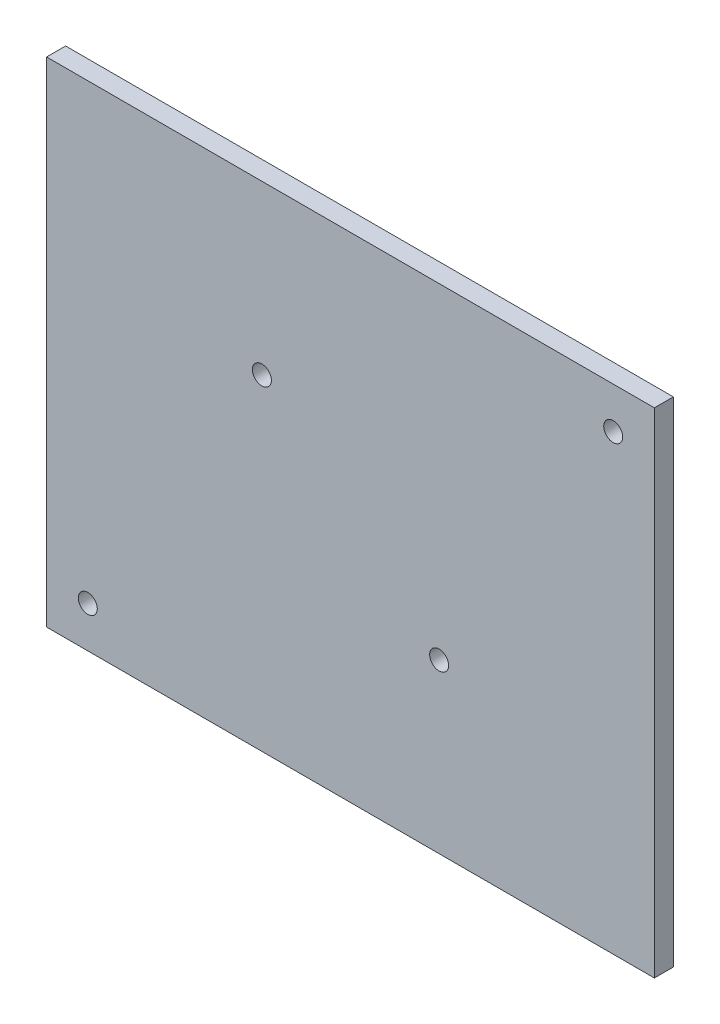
from build123d import *

# Parameters (mm, degrees)
CROQUIS1_W              = 96
CROQUIS1_H              = 78
SALIENTE_EXTRUIR2_DEPTH = 3
CROQUIS2_OUTSIDE_W      = 122.746
CROQUIS2_OUTSIDE_H      = 104.746
CROQUIS2_OUTSIDE_W_2    = 96
CROQUIS2_OUTSIDE_H_2    = 78
CROQUIS2_OUTSIDE_R      = 1.5
CORTAR_EXTRUIR1_DEPTH   = 62.919302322


with BuildPart() as part:
    # Croquis1 → Saliente-Extruir2 (new body)
    with BuildSketch(Plane.XY):
        Rectangle(CROQUIS1_W, CROQUIS1_H)
    extrude(amount=-SALIENTE_EXTRUIR2_DEPTH)

    # Croquis2 outside → Cortar-Extruir1 (cut, through all)
    # profile 1 of 5: a face of its own
    with BuildSketch(Plane.XY):
        Rectangle(CROQUIS2_OUTSIDE_W, CROQUIS2_OUTSIDE_H)
        Rectangle(CROQUIS2_OUTSIDE_W_2, CROQUIS2_OUTSIDE_H_2, mode=Mode.SUBTRACT)
    # profile 2 of 5: a face of its own
    with BuildSketch(Plane.XY):
        with Locations((-14, 12.5)):
            Circle(CROQUIS2_OUTSIDE_R)
    # profile 3 of 5: a face of its own
    with BuildSketch(Plane.XY):
        with Locations((14, -12.5)):
            Circle(CROQUIS2_OUTSIDE_R)
    # profile 4 of 5: a face of its own
    with BuildSketch(Plane.XY):
        with Locations((-41.5, -32.5)):
            Circle(CROQUIS2_OUTSIDE_R)
    # profile 5 of 5: a face of its own
    with BuildSketch(Plane.XY):
        with Locations((41.5, 32.5)):
            Circle(CROQUIS2_OUTSIDE_R)
    extrude(amount=-CORTAR_EXTRUIR1_DEPTH, mode=Mode.SUBTRACT)


solid = part.part
